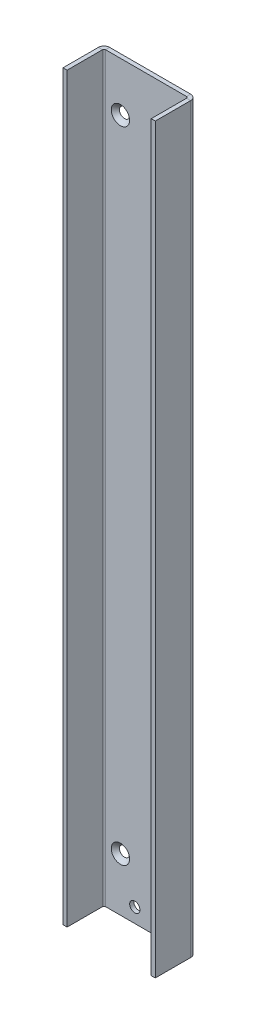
ISO-10303-21;
HEADER;
FILE_DESCRIPTION(('STEP AP214'),'2;1');
FILE_NAME('part.step','',(''),(''),'','','');
FILE_SCHEMA(('AUTOMOTIVE_DESIGN { 1 0 10303 214 1 1 1 1 }'));
ENDSEC;
DATA;
#1=APPLICATION_CONTEXT('core data for automotive mechanical design processes');
#2=APPLICATION_PROTOCOL_DEFINITION('international standard','automotive_design',2000,#1);
#3=PRODUCT_CONTEXT('',#1,'mechanical');
#4=PRODUCT('Part','Part','',(#3));
#5=PRODUCT_RELATED_PRODUCT_CATEGORY('part','',(#4));
#6=PRODUCT_DEFINITION_FORMATION('','',#4);
#7=PRODUCT_DEFINITION_CONTEXT('part definition',#1,'design');
#8=PRODUCT_DEFINITION('design','',#6,#7);
#9=PRODUCT_DEFINITION_SHAPE('','',#8);
#10=(LENGTH_UNIT() NAMED_UNIT(*) SI_UNIT(.MILLI.,.METRE.));
#11=(NAMED_UNIT(*) PLANE_ANGLE_UNIT() SI_UNIT($,.RADIAN.));
#12=(NAMED_UNIT(*) SI_UNIT($,.STERADIAN.) SOLID_ANGLE_UNIT());
#13=UNCERTAINTY_MEASURE_WITH_UNIT(LENGTH_MEASURE(1.E-05),#10,'distance_accuracy_value','');
#14=(GEOMETRIC_REPRESENTATION_CONTEXT(3) GLOBAL_UNCERTAINTY_ASSIGNED_CONTEXT((#13)) GLOBAL_UNIT_ASSIGNED_CONTEXT((#10,
#11,#12)) REPRESENTATION_CONTEXT('',''));
#15=CARTESIAN_POINT('',(0.,0.,0.));
#16=DIRECTION('',(0.,0.,1.));
#17=DIRECTION('',(1.,0.,0.));
#18=AXIS2_PLACEMENT_3D('',#15,#16,#17);
#19=CARTESIAN_POINT('',(0.,0.,-2.));
#20=DIRECTION('',(0.,0.,1.));
#21=DIRECTION('',(1.,0.,0.));
#22=AXIS2_PLACEMENT_3D('',#19,#20,#21);
#23=PLANE('',#22);
#24=CARTESIAN_POINT('',(-88.8014802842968,-337.450805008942,-2.00000000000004));
#25=DIRECTION('',(0.,0.,1.));
#26=DIRECTION('',(1.,0.,0.));
#27=AXIS2_PLACEMENT_3D('',#24,#25,#26);
#28=CIRCLE('',#27,2.5);
#29=CARTESIAN_POINT('',(-86.3014802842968,-337.450805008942,-2.00000000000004));
#30=VERTEX_POINT('',#29);
#31=EDGE_CURVE('E336',#30,#30,#28,.T.);
#32=ORIENTED_EDGE('',*,*,#31,.T.);
#33=EDGE_LOOP('',(#32));
#34=FACE_BOUND('',#33,.T.);
#35=CARTESIAN_POINT('',(-77.8014802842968,-323.450805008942,-2.00000000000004));
#36=DIRECTION('',(0.,0.,1.));
#37=DIRECTION('',(1.,0.,0.));
#38=AXIS2_PLACEMENT_3D('',#35,#36,#37);
#39=CIRCLE('',#38,2.5);
#40=CARTESIAN_POINT('',(-75.3014802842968,-323.450805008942,-2.00000000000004));
#41=VERTEX_POINT('',#40);
#42=EDGE_CURVE('E330',#41,#41,#39,.T.);
#43=ORIENTED_EDGE('',*,*,#42,.T.);
#44=EDGE_LOOP('',(#43));
#45=FACE_BOUND('',#44,.T.);
#46=CARTESIAN_POINT('',(-70.8014802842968,-6.4508050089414,-2.));
#47=DIRECTION('',(0.,0.,1.));
#48=DIRECTION('',(1.,0.,0.));
#49=AXIS2_PLACEMENT_3D('',#46,#47,#48);
#50=CIRCLE('',#49,2.48);
#51=CARTESIAN_POINT('',(-68.3214802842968,-6.4508050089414,-2.));
#52=VERTEX_POINT('',#51);
#53=EDGE_CURVE('E324',#52,#52,#50,.T.);
#54=ORIENTED_EDGE('',*,*,#53,.T.);
#55=EDGE_LOOP('',(#54));
#56=FACE_BOUND('',#55,.T.);
#57=CARTESIAN_POINT('',(-95.8014802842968,-6.4508050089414,-2.));
#58=DIRECTION('',(0.,0.,1.));
#59=DIRECTION('',(1.,0.,0.));
#60=AXIS2_PLACEMENT_3D('',#57,#58,#59);
#61=CIRCLE('',#60,2.48);
#62=CARTESIAN_POINT('',(-93.3214802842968,-6.4508050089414,-2.));
#63=VERTEX_POINT('',#62);
#64=EDGE_CURVE('E318',#63,#63,#61,.T.);
#65=ORIENTED_EDGE('',*,*,#64,.T.);
#66=EDGE_LOOP('',(#65));
#67=FACE_BOUND('',#66,.T.);
#68=CARTESIAN_POINT('',(-95.8014802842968,-318.450805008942,-2.));
#69=DIRECTION('',(0.,0.,1.));
#70=DIRECTION('',(1.,0.,0.));
#71=AXIS2_PLACEMENT_3D('',#68,#69,#70);
#72=CIRCLE('',#71,2.48);
#73=CARTESIAN_POINT('',(-93.3214802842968,-318.450805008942,-2.));
#74=VERTEX_POINT('',#73);
#75=EDGE_CURVE('E312',#74,#74,#72,.T.);
#76=ORIENTED_EDGE('',*,*,#75,.T.);
#77=EDGE_LOOP('',(#76));
#78=FACE_BOUND('',#77,.T.);
#79=CARTESIAN_POINT('',(-70.8014802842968,-318.450805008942,-2.));
#80=DIRECTION('',(0.,0.,1.));
#81=DIRECTION('',(1.,0.,0.));
#82=AXIS2_PLACEMENT_3D('',#79,#80,#81);
#83=CIRCLE('',#82,2.48);
#84=CARTESIAN_POINT('',(-68.3214802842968,-318.450805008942,-2.));
#85=VERTEX_POINT('',#84);
#86=EDGE_CURVE('E148',#85,#85,#83,.T.);
#87=ORIENTED_EDGE('',*,*,#86,.T.);
#88=EDGE_LOOP('',(#87));
#89=FACE_BOUND('',#88,.T.);
#90=DIRECTION('',(0.,1.,0.));
#91=VECTOR('',#90,1.);
#92=CARTESIAN_POINT('',(-63.5380802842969,17.5491949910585,-2.));
#93=LINE('',#92,#91);
#94=CARTESIAN_POINT('',(-63.5380802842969,17.5491949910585,-2.));
#95=VERTEX_POINT('',#94);
#96=CARTESIAN_POINT('',(-63.5380802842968,-344.450805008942,-2.));
#97=VERTEX_POINT('',#96);
#98=EDGE_CURVE('E149',#95,#97,#93,.F.);
#99=ORIENTED_EDGE('',*,*,#98,.T.);
#100=DIRECTION('',(1.,0.,0.));
#101=VECTOR('',#100,1.);
#102=CARTESIAN_POINT('',(-105.801480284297,-344.450805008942,-2.));
#103=LINE('',#102,#101);
#104=CARTESIAN_POINT('',(-103.064880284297,-344.450805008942,-2.));
#105=VERTEX_POINT('',#104);
#106=EDGE_CURVE('E25',#105,#97,#103,.T.);
#107=ORIENTED_EDGE('',*,*,#106,.F.);
#108=DIRECTION('',(0.,-1.,0.));
#109=VECTOR('',#108,1.);
#110=CARTESIAN_POINT('',(-103.064880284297,-344.450805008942,-2.));
#111=LINE('',#110,#109);
#112=CARTESIAN_POINT('',(-103.064880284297,17.5491949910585,-2.));
#113=VERTEX_POINT('',#112);
#114=EDGE_CURVE('E202',#105,#113,#111,.F.);
#115=ORIENTED_EDGE('',*,*,#114,.T.);
#116=DIRECTION('',(-1.,0.,0.));
#117=VECTOR('',#116,1.);
#118=CARTESIAN_POINT('',(-105.801480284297,17.5491949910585,-2.));
#119=LINE('',#118,#117);
#120=EDGE_CURVE('E11',#95,#113,#119,.T.);
#121=ORIENTED_EDGE('',*,*,#120,.F.);
#122=EDGE_LOOP('',(#99,#107,#115,#121));
#123=FACE_BOUND('',#122,.T.);
#124=ADVANCED_FACE('F16',(#34,#45,#56,#67,#78,#89,#123),#23,.F.);
#125=CARTESIAN_POINT('',(0.,0.,0.));
#126=DIRECTION('',(0.,0.,1.));
#127=DIRECTION('',(1.,0.,0.));
#128=AXIS2_PLACEMENT_3D('',#125,#126,#127);
#129=PLANE('',#128);
#130=CARTESIAN_POINT('',(-88.8014802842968,-337.450805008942,0.));
#131=DIRECTION('',(0.,0.,1.));
#132=DIRECTION('',(1.,0.,0.));
#133=AXIS2_PLACEMENT_3D('',#130,#131,#132);
#134=CIRCLE('',#133,2.5);
#135=CARTESIAN_POINT('',(-86.3014802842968,-337.450805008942,0.));
#136=VERTEX_POINT('',#135);
#137=EDGE_CURVE('E338',#136,#136,#134,.T.);
#138=ORIENTED_EDGE('',*,*,#137,.F.);
#139=EDGE_LOOP('',(#138));
#140=FACE_BOUND('',#139,.T.);
#141=CARTESIAN_POINT('',(-77.8014802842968,-323.450805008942,0.));
#142=DIRECTION('',(0.,0.,1.));
#143=DIRECTION('',(1.,0.,0.));
#144=AXIS2_PLACEMENT_3D('',#141,#142,#143);
#145=CIRCLE('',#144,2.5);
#146=CARTESIAN_POINT('',(-75.3014802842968,-323.450805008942,0.));
#147=VERTEX_POINT('',#146);
#148=EDGE_CURVE('E333',#147,#147,#145,.T.);
#149=ORIENTED_EDGE('',*,*,#148,.F.);
#150=EDGE_LOOP('',(#149));
#151=FACE_BOUND('',#150,.T.);
#152=CARTESIAN_POINT('',(-70.8014802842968,-6.4508050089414,0.));
#153=DIRECTION('',(0.,0.,1.));
#154=DIRECTION('',(1.,0.,0.));
#155=AXIS2_PLACEMENT_3D('',#152,#153,#154);
#156=CIRCLE('',#155,4.48);
#157=CARTESIAN_POINT('',(-66.3214802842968,-6.4508050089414,0.));
#158=VERTEX_POINT('',#157);
#159=EDGE_CURVE('E327',#158,#158,#156,.T.);
#160=ORIENTED_EDGE('',*,*,#159,.F.);
#161=EDGE_LOOP('',(#160));
#162=FACE_BOUND('',#161,.T.);
#163=CARTESIAN_POINT('',(-95.8014802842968,-6.4508050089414,0.));
#164=DIRECTION('',(0.,0.,1.));
#165=DIRECTION('',(1.,0.,0.));
#166=AXIS2_PLACEMENT_3D('',#163,#164,#165);
#167=CIRCLE('',#166,4.48);
#168=CARTESIAN_POINT('',(-91.3214802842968,-6.4508050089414,0.));
#169=VERTEX_POINT('',#168);
#170=EDGE_CURVE('E321',#169,#169,#167,.T.);
#171=ORIENTED_EDGE('',*,*,#170,.F.);
#172=EDGE_LOOP('',(#171));
#173=FACE_BOUND('',#172,.T.);
#174=CARTESIAN_POINT('',(-95.8014802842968,-318.450805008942,0.));
#175=DIRECTION('',(0.,0.,1.));
#176=DIRECTION('',(1.,0.,0.));
#177=AXIS2_PLACEMENT_3D('',#174,#175,#176);
#178=CIRCLE('',#177,4.48);
#179=CARTESIAN_POINT('',(-91.3214802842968,-318.450805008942,0.));
#180=VERTEX_POINT('',#179);
#181=EDGE_CURVE('E315',#180,#180,#178,.T.);
#182=ORIENTED_EDGE('',*,*,#181,.F.);
#183=EDGE_LOOP('',(#182));
#184=FACE_BOUND('',#183,.T.);
#185=CARTESIAN_POINT('',(-70.8014802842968,-318.450805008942,0.));
#186=DIRECTION('',(0.,0.,1.));
#187=DIRECTION('',(1.,0.,0.));
#188=AXIS2_PLACEMENT_3D('',#185,#186,#187);
#189=CIRCLE('',#188,4.48);
#190=CARTESIAN_POINT('',(-66.3214802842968,-318.450805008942,0.));
#191=VERTEX_POINT('',#190);
#192=EDGE_CURVE('E309',#191,#191,#189,.T.);
#193=ORIENTED_EDGE('',*,*,#192,.F.);
#194=EDGE_LOOP('',(#193));
#195=FACE_BOUND('',#194,.T.);
#196=DIRECTION('',(1.,0.,0.));
#197=VECTOR('',#196,1.);
#198=CARTESIAN_POINT('',(-105.801480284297,-344.450805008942,0.));
#199=LINE('',#198,#197);
#200=CARTESIAN_POINT('',(-103.064880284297,-344.450805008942,0.));
#201=VERTEX_POINT('',#200);
#202=CARTESIAN_POINT('',(-63.5380802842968,-344.450805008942,0.));
#203=VERTEX_POINT('',#202);
#204=EDGE_CURVE('E220',#201,#203,#199,.T.);
#205=ORIENTED_EDGE('',*,*,#204,.T.);
#206=DIRECTION('',(0.,1.,0.));
#207=VECTOR('',#206,1.);
#208=CARTESIAN_POINT('',(-63.5380802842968,17.5491949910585,0.));
#209=LINE('',#208,#207);
#210=CARTESIAN_POINT('',(-63.5380802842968,17.5491949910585,0.));
#211=VERTEX_POINT('',#210);
#212=EDGE_CURVE('E161',#211,#203,#209,.F.);
#213=ORIENTED_EDGE('',*,*,#212,.F.);
#214=DIRECTION('',(-1.,0.,0.));
#215=VECTOR('',#214,1.);
#216=CARTESIAN_POINT('',(-105.801480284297,17.5491949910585,0.));
#217=LINE('',#216,#215);
#218=CARTESIAN_POINT('',(-103.064880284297,17.5491949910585,0.));
#219=VERTEX_POINT('',#218);
#220=EDGE_CURVE('E20',#211,#219,#217,.T.);
#221=ORIENTED_EDGE('',*,*,#220,.T.);
#222=DIRECTION('',(0.,-1.,0.));
#223=VECTOR('',#222,1.);
#224=CARTESIAN_POINT('',(-103.064880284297,-344.450805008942,0.));
#225=LINE('',#224,#223);
#226=EDGE_CURVE('E33',#201,#219,#225,.F.);
#227=ORIENTED_EDGE('',*,*,#226,.F.);
#228=EDGE_LOOP('',(#205,#213,#221,#227));
#229=FACE_BOUND('',#228,.T.);
#230=ADVANCED_FACE('F225',(#140,#151,#162,#173,#184,#195,#229),#129,.T.);
#231=CARTESIAN_POINT('',(-105.801480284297,17.5491949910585,-2.));
#232=DIRECTION('',(0.,1.,0.));
#233=DIRECTION('',(0.,0.,1.));
#234=AXIS2_PLACEMENT_3D('',#231,#232,#233);
#235=PLANE('',#234);
#236=ORIENTED_EDGE('',*,*,#220,.F.);
#237=DIRECTION('',(0.,0.,-1.));
#238=VECTOR('',#237,1.);
#239=CARTESIAN_POINT('',(-63.5380802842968,17.5491949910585,0.));
#240=LINE('',#239,#238);
#241=EDGE_CURVE('E155',#211,#95,#240,.T.);
#242=ORIENTED_EDGE('',*,*,#241,.T.);
#243=ORIENTED_EDGE('',*,*,#120,.T.);
#244=DIRECTION('',(0.,0.,-1.));
#245=VECTOR('',#244,1.);
#246=CARTESIAN_POINT('',(-103.064880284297,17.5491949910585,0.));
#247=LINE('',#246,#245);
#248=EDGE_CURVE('E217',#219,#113,#247,.T.);
#249=ORIENTED_EDGE('',*,*,#248,.F.);
#250=EDGE_LOOP('',(#236,#242,#243,#249));
#251=FACE_BOUND('',#250,.T.);
#252=ADVANCED_FACE('F227',(#251),#235,.T.);
#253=CARTESIAN_POINT('',(-105.801480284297,-344.450805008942,-2.));
#254=DIRECTION('',(0.,-1.,0.));
#255=DIRECTION('',(0.,0.,-1.));
#256=AXIS2_PLACEMENT_3D('',#253,#254,#255);
#257=PLANE('',#256);
#258=DIRECTION('',(0.,0.,-1.));
#259=VECTOR('',#258,1.);
#260=CARTESIAN_POINT('',(-63.5380802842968,-344.450805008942,0.));
#261=LINE('',#260,#259);
#262=EDGE_CURVE('E167',#203,#97,#261,.T.);
#263=ORIENTED_EDGE('',*,*,#262,.F.);
#264=ORIENTED_EDGE('',*,*,#204,.F.);
#265=DIRECTION('',(0.,0.,-1.));
#266=VECTOR('',#265,1.);
#267=CARTESIAN_POINT('',(-103.064880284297,-344.450805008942,0.));
#268=LINE('',#267,#266);
#269=EDGE_CURVE('E208',#201,#105,#268,.T.);
#270=ORIENTED_EDGE('',*,*,#269,.T.);
#271=ORIENTED_EDGE('',*,*,#106,.T.);
#272=EDGE_LOOP('',(#263,#264,#270,#271));
#273=FACE_BOUND('',#272,.T.);
#274=ADVANCED_FACE('F18',(#273),#257,.T.);
#275=CARTESIAN_POINT('',(-103.064880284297,17.5491949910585,0.7366));
#276=DIRECTION('',(0.,1.,0.));
#277=DIRECTION('',(0.,0.,1.));
#278=AXIS2_PLACEMENT_3D('',#275,#276,#277);
#279=PLANE('',#278);
#280=DIRECTION('',(1.,0.,0.));
#281=VECTOR('',#280,1.);
#282=CARTESIAN_POINT('',(-105.801480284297,17.5491949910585,0.7366));
#283=LINE('',#282,#281);
#284=CARTESIAN_POINT('',(-103.801480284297,17.5491949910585,0.7366));
#285=VERTEX_POINT('',#284);
#286=CARTESIAN_POINT('',(-105.801480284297,17.5491949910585,0.73659999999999));
#287=VERTEX_POINT('',#286);
#288=EDGE_CURVE('E170',#285,#287,#283,.F.);
#289=ORIENTED_EDGE('',*,*,#288,.F.);
#290=CARTESIAN_POINT('',(-103.064880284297,17.5491949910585,0.7366));
#291=DIRECTION('',(0.,-1.,0.));
#292=DIRECTION('',(0.,0.,-1.));
#293=AXIS2_PLACEMENT_3D('',#290,#291,#292);
#294=CIRCLE('',#293,0.736600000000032);
#295=EDGE_CURVE('E211',#219,#285,#294,.F.);
#296=ORIENTED_EDGE('',*,*,#295,.F.);
#297=ORIENTED_EDGE('',*,*,#248,.T.);
#298=CARTESIAN_POINT('',(-103.064880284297,17.5491949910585,0.7366));
#299=DIRECTION('',(0.,-1.,0.));
#300=DIRECTION('',(0.,0.,-1.));
#301=AXIS2_PLACEMENT_3D('',#298,#299,#300);
#302=CIRCLE('',#301,2.7366);
#303=EDGE_CURVE('E204',#113,#287,#302,.F.);
#304=ORIENTED_EDGE('',*,*,#303,.T.);
#305=EDGE_LOOP('',(#289,#296,#297,#304));
#306=FACE_BOUND('',#305,.T.);
#307=ADVANCED_FACE('F235',(#306),#279,.T.);
#308=CARTESIAN_POINT('',(-103.064880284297,-344.450805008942,0.736600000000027));
#309=DIRECTION('',(0.,1.,0.));
#310=DIRECTION('',(0.,0.,1.));
#311=AXIS2_PLACEMENT_3D('',#308,#309,#310);
#312=PLANE('',#311);
#313=CARTESIAN_POINT('',(-103.064880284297,-344.450805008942,0.736600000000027));
#314=DIRECTION('',(0.,-1.,0.));
#315=DIRECTION('',(0.,0.,-1.));
#316=AXIS2_PLACEMENT_3D('',#313,#314,#315);
#317=CIRCLE('',#316,0.736600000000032);
#318=CARTESIAN_POINT('',(-103.801480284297,-344.450805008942,0.736600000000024));
#319=VERTEX_POINT('',#318);
#320=EDGE_CURVE('E175',#319,#201,#317,.T.);
#321=ORIENTED_EDGE('',*,*,#320,.F.);
#322=DIRECTION('',(1.,0.,0.));
#323=VECTOR('',#322,1.);
#324=CARTESIAN_POINT('',(-103.801480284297,-344.450805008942,0.736600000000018));
#325=LINE('',#324,#323);
#326=CARTESIAN_POINT('',(-105.801480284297,-344.450805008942,0.73660000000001));
#327=VERTEX_POINT('',#326);
#328=EDGE_CURVE('E195',#319,#327,#325,.F.);
#329=ORIENTED_EDGE('',*,*,#328,.T.);
#330=CARTESIAN_POINT('',(-103.064880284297,-344.450805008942,0.736600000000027));
#331=DIRECTION('',(0.,-1.,0.));
#332=DIRECTION('',(0.,0.,-1.));
#333=AXIS2_PLACEMENT_3D('',#330,#331,#332);
#334=CIRCLE('',#333,2.7366);
#335=EDGE_CURVE('E205',#327,#105,#334,.T.);
#336=ORIENTED_EDGE('',*,*,#335,.T.);
#337=ORIENTED_EDGE('',*,*,#269,.F.);
#338=EDGE_LOOP('',(#321,#329,#336,#337));
#339=FACE_BOUND('',#338,.T.);
#340=ADVANCED_FACE('F256',(#339),#312,.F.);
#341=CARTESIAN_POINT('',(-103.064880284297,-344.450805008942,0.736600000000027));
#342=DIRECTION('',(0.,-1.,0.));
#343=DIRECTION('',(-1.,0.,0.));
#344=AXIS2_PLACEMENT_3D('',#341,#342,#343);
#345=CYLINDRICAL_SURFACE('',#344,2.7366);
#346=ORIENTED_EDGE('',*,*,#114,.F.);
#347=ORIENTED_EDGE('',*,*,#335,.F.);
#348=DIRECTION('',(0.,-1.,0.));
#349=VECTOR('',#348,1.);
#350=CARTESIAN_POINT('',(-105.801480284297,17.5491949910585,0.7366));
#351=LINE('',#350,#349);
#352=EDGE_CURVE('E193',#327,#287,#351,.F.);
#353=ORIENTED_EDGE('',*,*,#352,.T.);
#354=ORIENTED_EDGE('',*,*,#303,.F.);
#355=EDGE_LOOP('',(#346,#347,#353,#354));
#356=FACE_BOUND('',#355,.T.);
#357=ADVANCED_FACE('F525',(#356),#345,.T.);
#358=CARTESIAN_POINT('',(-103.064880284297,-344.450805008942,0.736600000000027));
#359=DIRECTION('',(0.,-1.,0.));
#360=DIRECTION('',(-1.,0.,0.));
#361=AXIS2_PLACEMENT_3D('',#358,#359,#360);
#362=CYLINDRICAL_SURFACE('',#361,0.736600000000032);
#363=ORIENTED_EDGE('',*,*,#226,.T.);
#364=ORIENTED_EDGE('',*,*,#295,.T.);
#365=DIRECTION('',(0.,-1.,0.));
#366=VECTOR('',#365,1.);
#367=CARTESIAN_POINT('',(-103.801480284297,17.5491949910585,0.7366));
#368=LINE('',#367,#366);
#369=EDGE_CURVE('E198',#285,#319,#368,.T.);
#370=ORIENTED_EDGE('',*,*,#369,.T.);
#371=ORIENTED_EDGE('',*,*,#320,.T.);
#372=EDGE_LOOP('',(#363,#364,#370,#371));
#373=FACE_BOUND('',#372,.T.);
#374=ADVANCED_FACE('F232',(#373),#362,.F.);
#375=CARTESIAN_POINT('',(-105.801480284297,17.5491949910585,0.));
#376=DIRECTION('',(0.,-1.,0.));
#377=DIRECTION('',(1.,0.,0.));
#378=AXIS2_PLACEMENT_3D('',#375,#376,#377);
#379=PLANE('',#378);
#380=ORIENTED_EDGE('',*,*,#288,.T.);
#381=DIRECTION('',(0.,0.,-1.));
#382=VECTOR('',#381,1.);
#383=CARTESIAN_POINT('',(-105.801480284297,17.5491949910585,-4.14841432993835E-13));
#384=LINE('',#383,#382);
#385=CARTESIAN_POINT('',(-105.801480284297,17.5491949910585,18.));
#386=VERTEX_POINT('',#385);
#387=EDGE_CURVE('E183',#386,#287,#384,.T.);
#388=ORIENTED_EDGE('',*,*,#387,.F.);
#389=DIRECTION('',(1.,0.,0.));
#390=VECTOR('',#389,1.);
#391=CARTESIAN_POINT('',(-105.801480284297,17.5491949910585,18.));
#392=LINE('',#391,#390);
#393=CARTESIAN_POINT('',(-103.801480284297,17.5491949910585,18.));
#394=VERTEX_POINT('',#393);
#395=EDGE_CURVE('E176',#386,#394,#392,.T.);
#396=ORIENTED_EDGE('',*,*,#395,.T.);
#397=DIRECTION('',(0.,0.,1.));
#398=VECTOR('',#397,1.);
#399=CARTESIAN_POINT('',(-103.801480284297,17.5491949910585,0.));
#400=LINE('',#399,#398);
#401=EDGE_CURVE('E190',#394,#285,#400,.F.);
#402=ORIENTED_EDGE('',*,*,#401,.T.);
#403=EDGE_LOOP('',(#380,#388,#396,#402));
#404=FACE_BOUND('',#403,.T.);
#405=ADVANCED_FACE('F238',(#404),#379,.F.);
#406=CARTESIAN_POINT('',(-105.801480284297,-344.450805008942,18.));
#407=DIRECTION('',(0.,1.,0.));
#408=DIRECTION('',(-1.,0.,0.));
#409=AXIS2_PLACEMENT_3D('',#406,#407,#408);
#410=PLANE('',#409);
#411=ORIENTED_EDGE('',*,*,#328,.F.);
#412=DIRECTION('',(0.,0.,-1.));
#413=VECTOR('',#412,1.);
#414=CARTESIAN_POINT('',(-103.801480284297,-344.450805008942,18.));
#415=LINE('',#414,#413);
#416=CARTESIAN_POINT('',(-103.801480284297,-344.450805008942,18.));
#417=VERTEX_POINT('',#416);
#418=EDGE_CURVE('E188',#319,#417,#415,.F.);
#419=ORIENTED_EDGE('',*,*,#418,.T.);
#420=DIRECTION('',(1.,0.,0.));
#421=VECTOR('',#420,1.);
#422=CARTESIAN_POINT('',(-105.801480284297,-344.450805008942,18.));
#423=LINE('',#422,#421);
#424=CARTESIAN_POINT('',(-105.801480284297,-344.450805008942,18.));
#425=VERTEX_POINT('',#424);
#426=EDGE_CURVE('E172',#425,#417,#423,.T.);
#427=ORIENTED_EDGE('',*,*,#426,.F.);
#428=DIRECTION('',(0.,0.,1.));
#429=VECTOR('',#428,1.);
#430=CARTESIAN_POINT('',(-105.801480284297,-344.450805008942,-4.14841432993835E-13));
#431=LINE('',#430,#429);
#432=EDGE_CURVE('E181',#327,#425,#431,.T.);
#433=ORIENTED_EDGE('',*,*,#432,.F.);
#434=EDGE_LOOP('',(#411,#419,#427,#433));
#435=FACE_BOUND('',#434,.T.);
#436=ADVANCED_FACE('F258',(#435),#410,.F.);
#437=CARTESIAN_POINT('',(-105.801480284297,0.,-4.14841432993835E-13));
#438=DIRECTION('',(1.,0.,0.));
#439=DIRECTION('',(0.,0.,-1.));
#440=AXIS2_PLACEMENT_3D('',#437,#438,#439);
#441=PLANE('',#440);
#442=ORIENTED_EDGE('',*,*,#352,.F.);
#443=ORIENTED_EDGE('',*,*,#432,.T.);
#444=DIRECTION('',(0.,1.,0.));
#445=VECTOR('',#444,1.);
#446=CARTESIAN_POINT('',(-105.801480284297,0.,18.));
#447=LINE('',#446,#445);
#448=EDGE_CURVE('E179',#425,#386,#447,.T.);
#449=ORIENTED_EDGE('',*,*,#448,.T.);
#450=ORIENTED_EDGE('',*,*,#387,.T.);
#451=EDGE_LOOP('',(#442,#443,#449,#450));
#452=FACE_BOUND('',#451,.T.);
#453=ADVANCED_FACE('F242',(#452),#441,.F.);
#454=CARTESIAN_POINT('',(-103.801480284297,0.,-4.07858470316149E-13));
#455=DIRECTION('',(1.,0.,0.));
#456=DIRECTION('',(0.,0.,-1.));
#457=AXIS2_PLACEMENT_3D('',#454,#455,#456);
#458=PLANE('',#457);
#459=ORIENTED_EDGE('',*,*,#418,.F.);
#460=ORIENTED_EDGE('',*,*,#369,.F.);
#461=ORIENTED_EDGE('',*,*,#401,.F.);
#462=DIRECTION('',(0.,-1.,0.));
#463=VECTOR('',#462,1.);
#464=CARTESIAN_POINT('',(-103.801480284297,17.5491949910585,18.));
#465=LINE('',#464,#463);
#466=EDGE_CURVE('E186',#417,#394,#465,.F.);
#467=ORIENTED_EDGE('',*,*,#466,.F.);
#468=EDGE_LOOP('',(#459,#460,#461,#467));
#469=FACE_BOUND('',#468,.T.);
#470=ADVANCED_FACE('F252',(#469),#458,.T.);
#471=CARTESIAN_POINT('',(-105.801480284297,17.5491949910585,18.));
#472=DIRECTION('',(0.,0.,-1.));
#473=DIRECTION('',(-1.,0.,0.));
#474=AXIS2_PLACEMENT_3D('',#471,#472,#473);
#475=PLANE('',#474);
#476=ORIENTED_EDGE('',*,*,#466,.T.);
#477=ORIENTED_EDGE('',*,*,#395,.F.);
#478=ORIENTED_EDGE('',*,*,#448,.F.);
#479=ORIENTED_EDGE('',*,*,#426,.T.);
#480=EDGE_LOOP('',(#476,#477,#478,#479));
#481=FACE_BOUND('',#480,.T.);
#482=ADVANCED_FACE('F248',(#481),#475,.F.);
#483=CARTESIAN_POINT('',(-63.5380802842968,-344.450805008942,0.7366));
#484=DIRECTION('',(0.,-1.,0.));
#485=DIRECTION('',(0.,0.,-1.));
#486=AXIS2_PLACEMENT_3D('',#483,#484,#485);
#487=PLANE('',#486);
#488=DIRECTION('',(-1.,0.,0.));
#489=VECTOR('',#488,1.);
#490=CARTESIAN_POINT('',(-60.8014802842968,-344.450805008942,0.73659999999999));
#491=LINE('',#490,#489);
#492=CARTESIAN_POINT('',(-62.8014802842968,-344.450805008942,0.736599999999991));
#493=VERTEX_POINT('',#492);
#494=CARTESIAN_POINT('',(-60.8014802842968,-344.450805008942,0.736599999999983));
#495=VERTEX_POINT('',#494);
#496=EDGE_CURVE('E131',#493,#495,#491,.F.);
#497=ORIENTED_EDGE('',*,*,#496,.F.);
#498=CARTESIAN_POINT('',(-63.5380802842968,-344.450805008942,0.7366));
#499=DIRECTION('',(0.,1.,0.));
#500=DIRECTION('',(0.,0.,1.));
#501=AXIS2_PLACEMENT_3D('',#498,#499,#500);
#502=CIRCLE('',#501,0.736600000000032);
#503=EDGE_CURVE('E158',#203,#493,#502,.F.);
#504=ORIENTED_EDGE('',*,*,#503,.F.);
#505=ORIENTED_EDGE('',*,*,#262,.T.);
#506=CARTESIAN_POINT('',(-63.5380802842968,-344.450805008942,0.7366));
#507=DIRECTION('',(0.,1.,0.));
#508=DIRECTION('',(0.,0.,1.));
#509=AXIS2_PLACEMENT_3D('',#506,#507,#508);
#510=CIRCLE('',#509,2.7366);
#511=EDGE_CURVE('E151',#97,#495,#510,.F.);
#512=ORIENTED_EDGE('',*,*,#511,.T.);
#513=EDGE_LOOP('',(#497,#504,#505,#512));
#514=FACE_BOUND('',#513,.T.);
#515=ADVANCED_FACE('F297',(#514),#487,.T.);
#516=CARTESIAN_POINT('',(-63.5380802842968,17.5491949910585,0.73660000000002));
#517=DIRECTION('',(0.,-1.,0.));
#518=DIRECTION('',(0.,0.,-1.));
#519=AXIS2_PLACEMENT_3D('',#516,#517,#518);
#520=PLANE('',#519);
#521=CARTESIAN_POINT('',(-63.5380802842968,17.5491949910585,0.73660000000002));
#522=DIRECTION('',(0.,1.,0.));
#523=DIRECTION('',(0.,0.,1.));
#524=AXIS2_PLACEMENT_3D('',#521,#522,#523);
#525=CIRCLE('',#524,0.736600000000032);
#526=CARTESIAN_POINT('',(-62.8014802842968,17.5491949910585,0.736600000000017));
#527=VERTEX_POINT('',#526);
#528=EDGE_CURVE('E164',#527,#211,#525,.T.);
#529=ORIENTED_EDGE('',*,*,#528,.F.);
#530=DIRECTION('',(-1.,0.,0.));
#531=VECTOR('',#530,1.);
#532=CARTESIAN_POINT('',(-62.8014802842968,17.5491949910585,0.736600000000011));
#533=LINE('',#532,#531);
#534=CARTESIAN_POINT('',(-60.8014802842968,17.5491949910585,0.7366));
#535=VERTEX_POINT('',#534);
#536=EDGE_CURVE('E142',#527,#535,#533,.F.);
#537=ORIENTED_EDGE('',*,*,#536,.T.);
#538=CARTESIAN_POINT('',(-63.5380802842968,17.5491949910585,0.73660000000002));
#539=DIRECTION('',(0.,1.,0.));
#540=DIRECTION('',(0.,0.,1.));
#541=AXIS2_PLACEMENT_3D('',#538,#539,#540);
#542=CIRCLE('',#541,2.7366);
#543=EDGE_CURVE('E152',#535,#95,#542,.T.);
#544=ORIENTED_EDGE('',*,*,#543,.T.);
#545=ORIENTED_EDGE('',*,*,#241,.F.);
#546=EDGE_LOOP('',(#529,#537,#544,#545));
#547=FACE_BOUND('',#546,.T.);
#548=ADVANCED_FACE('F365',(#547),#520,.F.);
#549=CARTESIAN_POINT('',(-63.5380802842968,17.5491949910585,0.73660000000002));
#550=DIRECTION('',(0.,1.,0.));
#551=DIRECTION('',(1.,0.,0.));
#552=AXIS2_PLACEMENT_3D('',#549,#550,#551);
#553=CYLINDRICAL_SURFACE('',#552,2.7366);
#554=ORIENTED_EDGE('',*,*,#98,.F.);
#555=ORIENTED_EDGE('',*,*,#543,.F.);
#556=DIRECTION('',(0.,1.,0.));
#557=VECTOR('',#556,1.);
#558=CARTESIAN_POINT('',(-60.8014802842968,-344.450805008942,0.73659999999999));
#559=LINE('',#558,#557);
#560=EDGE_CURVE('E140',#535,#495,#559,.F.);
#561=ORIENTED_EDGE('',*,*,#560,.T.);
#562=ORIENTED_EDGE('',*,*,#511,.F.);
#563=EDGE_LOOP('',(#554,#555,#561,#562));
#564=FACE_BOUND('',#563,.T.);
#565=ADVANCED_FACE('F300',(#564),#553,.T.);
#566=CARTESIAN_POINT('',(-63.5380802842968,17.5491949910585,0.73660000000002));
#567=DIRECTION('',(0.,1.,0.));
#568=DIRECTION('',(1.,0.,0.));
#569=AXIS2_PLACEMENT_3D('',#566,#567,#568);
#570=CYLINDRICAL_SURFACE('',#569,0.736600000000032);
#571=ORIENTED_EDGE('',*,*,#212,.T.);
#572=ORIENTED_EDGE('',*,*,#503,.T.);
#573=DIRECTION('',(0.,1.,0.));
#574=VECTOR('',#573,1.);
#575=CARTESIAN_POINT('',(-62.8014802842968,-344.450805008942,0.7366));
#576=LINE('',#575,#574);
#577=EDGE_CURVE('E145',#493,#527,#576,.T.);
#578=ORIENTED_EDGE('',*,*,#577,.T.);
#579=ORIENTED_EDGE('',*,*,#528,.T.);
#580=EDGE_LOOP('',(#571,#572,#578,#579));
#581=FACE_BOUND('',#580,.T.);
#582=ADVANCED_FACE('F367',(#581),#570,.F.);
#583=CARTESIAN_POINT('',(-60.8014802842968,-344.450805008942,0.));
#584=DIRECTION('',(0.,1.,0.));
#585=DIRECTION('',(-1.,0.,0.));
#586=AXIS2_PLACEMENT_3D('',#583,#584,#585);
#587=PLANE('',#586);
#588=ORIENTED_EDGE('',*,*,#496,.T.);
#589=DIRECTION('',(0.,0.,-1.));
#590=VECTOR('',#589,1.);
#591=CARTESIAN_POINT('',(-60.8014802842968,-344.450805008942,2.03964547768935E-13));
#592=LINE('',#591,#590);
#593=CARTESIAN_POINT('',(-60.8014802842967,-344.450805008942,18.));
#594=VERTEX_POINT('',#593);
#595=EDGE_CURVE('E112',#594,#495,#592,.T.);
#596=ORIENTED_EDGE('',*,*,#595,.F.);
#597=DIRECTION('',(-1.,0.,0.));
#598=VECTOR('',#597,1.);
#599=CARTESIAN_POINT('',(-60.8014802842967,-344.450805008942,18.));
#600=LINE('',#599,#598);
#601=CARTESIAN_POINT('',(-62.8014802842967,-344.450805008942,18.));
#602=VERTEX_POINT('',#601);
#603=EDGE_CURVE('E118',#594,#602,#600,.T.);
#604=ORIENTED_EDGE('',*,*,#603,.T.);
#605=DIRECTION('',(0.,0.,1.));
#606=VECTOR('',#605,1.);
#607=CARTESIAN_POINT('',(-62.8014802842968,-344.450805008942,0.));
#608=LINE('',#607,#606);
#609=EDGE_CURVE('E138',#602,#493,#608,.F.);
#610=ORIENTED_EDGE('',*,*,#609,.T.);
#611=EDGE_LOOP('',(#588,#596,#604,#610));
#612=FACE_BOUND('',#611,.T.);
#613=ADVANCED_FACE('F130',(#612),#587,.F.);
#614=CARTESIAN_POINT('',(-60.8014802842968,17.5491949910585,18.));
#615=DIRECTION('',(0.,-1.,0.));
#616=DIRECTION('',(0.,0.,-1.));
#617=AXIS2_PLACEMENT_3D('',#614,#615,#616);
#618=PLANE('',#617);
#619=ORIENTED_EDGE('',*,*,#536,.F.);
#620=DIRECTION('',(0.,0.,-1.));
#621=VECTOR('',#620,1.);
#622=CARTESIAN_POINT('',(-62.8014802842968,17.5491949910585,18.));
#623=LINE('',#622,#621);
#624=CARTESIAN_POINT('',(-62.8014802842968,17.5491949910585,18.));
#625=VERTEX_POINT('',#624);
#626=EDGE_CURVE('E134',#527,#625,#623,.F.);
#627=ORIENTED_EDGE('',*,*,#626,.T.);
#628=DIRECTION('',(-1.,0.,0.));
#629=VECTOR('',#628,1.);
#630=CARTESIAN_POINT('',(-60.8014802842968,17.5491949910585,18.));
#631=LINE('',#630,#629);
#632=CARTESIAN_POINT('',(-60.8014802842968,17.5491949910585,18.));
#633=VERTEX_POINT('',#632);
#634=EDGE_CURVE('E127',#633,#625,#631,.T.);
#635=ORIENTED_EDGE('',*,*,#634,.F.);
#636=DIRECTION('',(0.,0.,1.));
#637=VECTOR('',#636,1.);
#638=CARTESIAN_POINT('',(-60.8014802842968,17.5491949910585,1.97199436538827E-13));
#639=LINE('',#638,#637);
#640=EDGE_CURVE('E114',#535,#633,#639,.T.);
#641=ORIENTED_EDGE('',*,*,#640,.F.);
#642=EDGE_LOOP('',(#619,#627,#635,#641));
#643=FACE_BOUND('',#642,.T.);
#644=ADVANCED_FACE('F303',(#643),#618,.F.);
#645=CARTESIAN_POINT('',(-60.8014802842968,0.,2.03964547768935E-13));
#646=DIRECTION('',(-1.,0.,0.));
#647=DIRECTION('',(0.,0.,1.));
#648=AXIS2_PLACEMENT_3D('',#645,#646,#647);
#649=PLANE('',#648);
#650=ORIENTED_EDGE('',*,*,#560,.F.);
#651=ORIENTED_EDGE('',*,*,#640,.T.);
#652=DIRECTION('',(0.,-1.,0.));
#653=VECTOR('',#652,1.);
#654=CARTESIAN_POINT('',(-60.8014802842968,0.,18.));
#655=LINE('',#654,#653);
#656=EDGE_CURVE('E107',#633,#594,#655,.T.);
#657=ORIENTED_EDGE('',*,*,#656,.T.);
#658=ORIENTED_EDGE('',*,*,#595,.T.);
#659=EDGE_LOOP('',(#650,#651,#657,#658));
#660=FACE_BOUND('',#659,.T.);
#661=ADVANCED_FACE('F110',(#660),#649,.F.);
#662=CARTESIAN_POINT('',(-62.8014802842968,0.,2.10947510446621E-13));
#663=DIRECTION('',(-1.,0.,0.));
#664=DIRECTION('',(0.,0.,1.));
#665=AXIS2_PLACEMENT_3D('',#662,#663,#664);
#666=PLANE('',#665);
#667=ORIENTED_EDGE('',*,*,#626,.F.);
#668=ORIENTED_EDGE('',*,*,#577,.F.);
#669=ORIENTED_EDGE('',*,*,#609,.F.);
#670=DIRECTION('',(0.,1.,0.));
#671=VECTOR('',#670,1.);
#672=CARTESIAN_POINT('',(-62.8014802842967,-344.450805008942,18.));
#673=LINE('',#672,#671);
#674=EDGE_CURVE('E123',#625,#602,#673,.F.);
#675=ORIENTED_EDGE('',*,*,#674,.F.);
#676=EDGE_LOOP('',(#667,#668,#669,#675));
#677=FACE_BOUND('',#676,.T.);
#678=ADVANCED_FACE('F370',(#677),#666,.T.);
#679=CARTESIAN_POINT('',(-60.8014802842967,-344.450805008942,18.));
#680=DIRECTION('',(0.,0.,-1.));
#681=DIRECTION('',(-1.,0.,0.));
#682=AXIS2_PLACEMENT_3D('',#679,#680,#681);
#683=PLANE('',#682);
#684=ORIENTED_EDGE('',*,*,#674,.T.);
#685=ORIENTED_EDGE('',*,*,#603,.F.);
#686=ORIENTED_EDGE('',*,*,#656,.F.);
#687=ORIENTED_EDGE('',*,*,#634,.T.);
#688=EDGE_LOOP('',(#684,#685,#686,#687));
#689=FACE_BOUND('',#688,.T.);
#690=ADVANCED_FACE('F121',(#689),#683,.F.);
#691=CARTESIAN_POINT('',(-70.8014802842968,-318.450805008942,0.));
#692=DIRECTION('',(0.,0.,1.));
#693=DIRECTION('',(1.,0.,0.));
#694=AXIS2_PLACEMENT_3D('',#691,#692,#693);
#695=CONICAL_SURFACE('',#694,4.48,0.785398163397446);
#696=ORIENTED_EDGE('',*,*,#192,.T.);
#697=EDGE_LOOP('',(#696));
#698=FACE_BOUND('',#697,.T.);
#699=ORIENTED_EDGE('',*,*,#86,.F.);
#700=EDGE_LOOP('',(#699));
#701=FACE_BOUND('',#700,.T.);
#702=ADVANCED_FACE('F354',(#698,#701),#695,.F.);
#703=CARTESIAN_POINT('',(-95.8014802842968,-318.450805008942,0.));
#704=DIRECTION('',(0.,0.,1.));
#705=DIRECTION('',(1.,0.,0.));
#706=AXIS2_PLACEMENT_3D('',#703,#704,#705);
#707=CONICAL_SURFACE('',#706,4.48,0.785398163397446);
#708=ORIENTED_EDGE('',*,*,#181,.T.);
#709=EDGE_LOOP('',(#708));
#710=FACE_BOUND('',#709,.T.);
#711=ORIENTED_EDGE('',*,*,#75,.F.);
#712=EDGE_LOOP('',(#711));
#713=FACE_BOUND('',#712,.T.);
#714=ADVANCED_FACE('F357',(#710,#713),#707,.F.);
#715=CARTESIAN_POINT('',(-95.8014802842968,-6.4508050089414,0.));
#716=DIRECTION('',(0.,0.,1.));
#717=DIRECTION('',(1.,0.,0.));
#718=AXIS2_PLACEMENT_3D('',#715,#716,#717);
#719=CONICAL_SURFACE('',#718,4.48,0.785398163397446);
#720=ORIENTED_EDGE('',*,*,#170,.T.);
#721=EDGE_LOOP('',(#720));
#722=FACE_BOUND('',#721,.T.);
#723=ORIENTED_EDGE('',*,*,#64,.F.);
#724=EDGE_LOOP('',(#723));
#725=FACE_BOUND('',#724,.T.);
#726=ADVANCED_FACE('F475',(#722,#725),#719,.F.);
#727=CARTESIAN_POINT('',(-70.8014802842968,-6.4508050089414,0.));
#728=DIRECTION('',(0.,0.,1.));
#729=DIRECTION('',(1.,0.,0.));
#730=AXIS2_PLACEMENT_3D('',#727,#728,#729);
#731=CONICAL_SURFACE('',#730,4.48,0.785398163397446);
#732=ORIENTED_EDGE('',*,*,#159,.T.);
#733=EDGE_LOOP('',(#732));
#734=FACE_BOUND('',#733,.T.);
#735=ORIENTED_EDGE('',*,*,#53,.F.);
#736=EDGE_LOOP('',(#735));
#737=FACE_BOUND('',#736,.T.);
#738=ADVANCED_FACE('F485',(#734,#737),#731,.F.);
#739=CARTESIAN_POINT('',(-77.8014802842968,-323.450805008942,0.));
#740=DIRECTION('',(0.,0.,1.));
#741=DIRECTION('',(1.,0.,0.));
#742=AXIS2_PLACEMENT_3D('',#739,#740,#741);
#743=CYLINDRICAL_SURFACE('',#742,2.5);
#744=ORIENTED_EDGE('',*,*,#42,.F.);
#745=EDGE_LOOP('',(#744));
#746=FACE_BOUND('',#745,.T.);
#747=ORIENTED_EDGE('',*,*,#148,.T.);
#748=EDGE_LOOP('',(#747));
#749=FACE_BOUND('',#748,.T.);
#750=ADVANCED_FACE('F495',(#746,#749),#743,.F.);
#751=CARTESIAN_POINT('',(-88.8014802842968,-337.450805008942,0.));
#752=DIRECTION('',(0.,0.,1.));
#753=DIRECTION('',(1.,0.,0.));
#754=AXIS2_PLACEMENT_3D('',#751,#752,#753);
#755=CYLINDRICAL_SURFACE('',#754,2.5);
#756=ORIENTED_EDGE('',*,*,#31,.F.);
#757=EDGE_LOOP('',(#756));
#758=FACE_BOUND('',#757,.T.);
#759=ORIENTED_EDGE('',*,*,#137,.T.);
#760=EDGE_LOOP('',(#759));
#761=FACE_BOUND('',#760,.T.);
#762=ADVANCED_FACE('F342',(#758,#761),#755,.F.);
#763=CLOSED_SHELL('',(#124,#230,#252,#274,#307,#340,#357,#374,#405,#436,#453,#470,#482,#515,
#548,#565,#582,#613,#644,#661,#678,#690,#702,#714,#726,#738,#750,#762));
#764=MANIFOLD_SOLID_BREP('B1',#763);
#765=ADVANCED_BREP_SHAPE_REPRESENTATION('',(#18,#764),#14);
#766=SHAPE_DEFINITION_REPRESENTATION(#9,#765);
ENDSEC;
END-ISO-10303-21;
